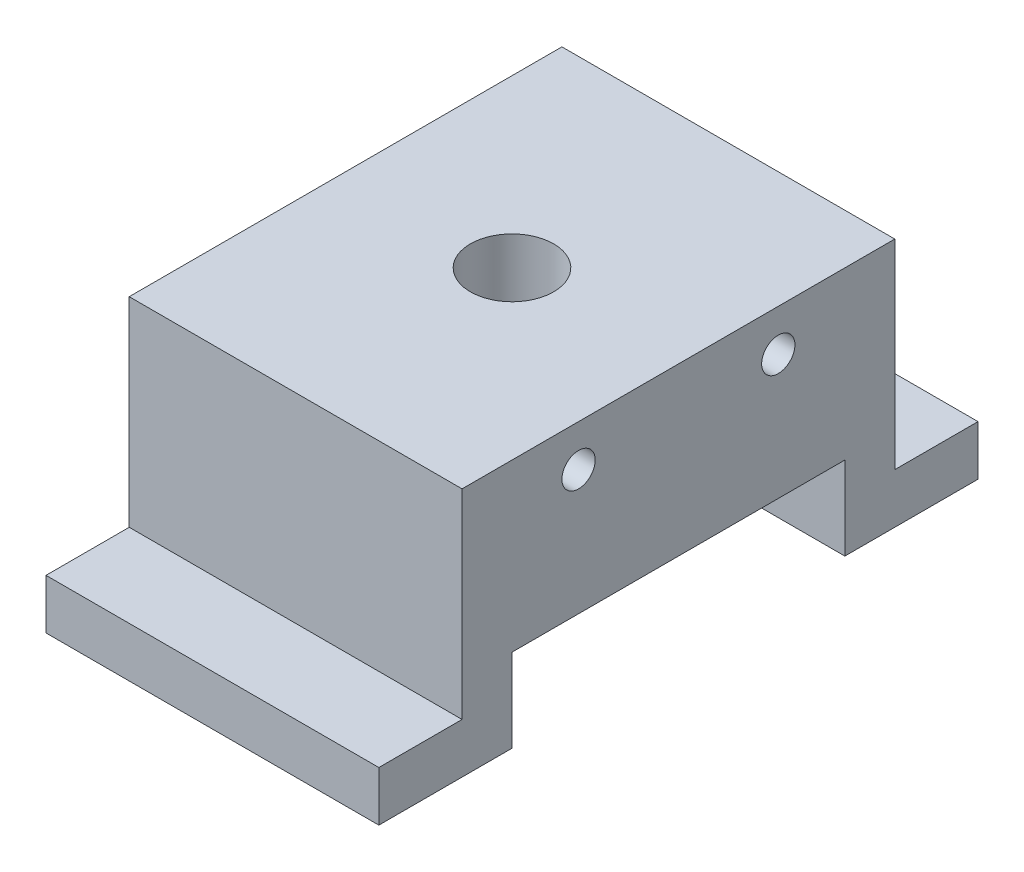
from build123d import *

# Parameters (mm, degrees)
SKETCH1_R           = 1
BOSS_EXTRUDE1_DEPTH = 10
SKETCH2_R           = 7
CUT_EXTRUDE1_DEPTH  = 5
SKETCH3_R           = 2.5
CUT_EXTRUDE2_DEPTH  = 23.891046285


with BuildPart() as part:
    # Sketch1 → Boss-Extrude1 (new, symmetric)
    with BuildSketch(Plane(origin=(0, 0, 0), x_dir=(0, 0, -1), z_dir=(1, 0, 0))):
        Polygon((-10, 0), (-18, 0), (-18, 3), (-13, 3), (-13, 15), (13, 15), (13, 3), (18, 3), (18, 0), (10, 0), (10, 5), (-10, 5), align=None)
        with Locations((-6, 12.5)):
            Circle(SKETCH1_R, mode=Mode.SUBTRACT)
        with Locations((6, 12.5)):
            Circle(SKETCH1_R, mode=Mode.SUBTRACT)
    extrude(amount=BOSS_EXTRUDE1_DEPTH, both=True)

    # Sketch2 → Cut-Extrude1 (cut)
    with BuildSketch(Plane.XZ.offset(-5)):
        with Locations(Location((0, 0, 0), (0, 0, 270))):
            Circle(SKETCH2_R)
    extrude(amount=-CUT_EXTRUDE1_DEPTH, mode=Mode.SUBTRACT)

    # Sketch3 → Cut-Extrude2 (cut, through all)
    with BuildSketch(Plane.XZ.offset(-10)):
        with Locations(Location((0, 0, 0), (0, 0, 270))):
            Circle(SKETCH3_R)
    extrude(amount=-CUT_EXTRUDE2_DEPTH, mode=Mode.SUBTRACT)


solid = part.part
